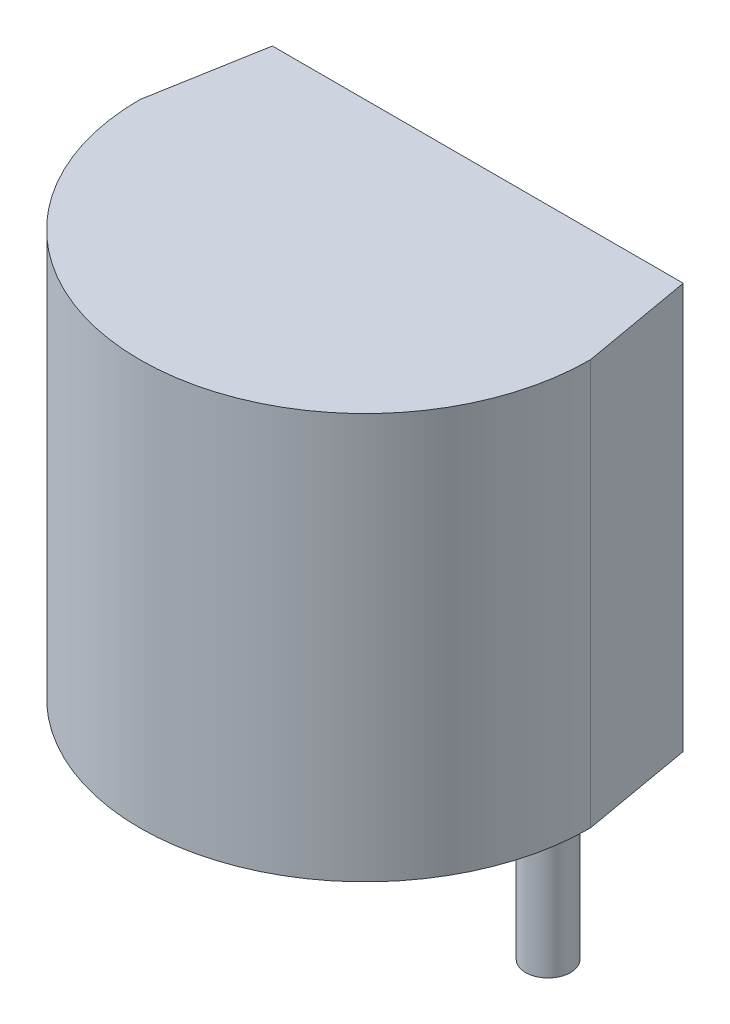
ISO-10303-21;
HEADER;
FILE_DESCRIPTION(('STEP AP214'),'2;1');
FILE_NAME('part.step','',(''),(''),'','','');
FILE_SCHEMA(('AUTOMOTIVE_DESIGN { 1 0 10303 214 1 1 1 1 }'));
ENDSEC;
DATA;
#1=APPLICATION_CONTEXT('core data for automotive mechanical design processes');
#2=APPLICATION_PROTOCOL_DEFINITION('international standard','automotive_design',2000,#1);
#3=PRODUCT_CONTEXT('',#1,'mechanical');
#4=PRODUCT('Part','Part','',(#3));
#5=PRODUCT_RELATED_PRODUCT_CATEGORY('part','',(#4));
#6=PRODUCT_DEFINITION_FORMATION('','',#4);
#7=PRODUCT_DEFINITION_CONTEXT('part definition',#1,'design');
#8=PRODUCT_DEFINITION('design','',#6,#7);
#9=PRODUCT_DEFINITION_SHAPE('','',#8);
#10=(LENGTH_UNIT() NAMED_UNIT(*) SI_UNIT(.MILLI.,.METRE.));
#11=(NAMED_UNIT(*) PLANE_ANGLE_UNIT() SI_UNIT($,.RADIAN.));
#12=(NAMED_UNIT(*) SI_UNIT($,.STERADIAN.) SOLID_ANGLE_UNIT());
#13=UNCERTAINTY_MEASURE_WITH_UNIT(LENGTH_MEASURE(1.E-05),#10,'distance_accuracy_value','');
#14=(GEOMETRIC_REPRESENTATION_CONTEXT(3) GLOBAL_UNCERTAINTY_ASSIGNED_CONTEXT((#13)) GLOBAL_UNIT_ASSIGNED_CONTEXT((#10,
#11,#12)) REPRESENTATION_CONTEXT('',''));
#15=CARTESIAN_POINT('',(0.,0.,0.));
#16=DIRECTION('',(0.,0.,1.));
#17=DIRECTION('',(1.,0.,0.));
#18=AXIS2_PLACEMENT_3D('',#15,#16,#17);
#19=CARTESIAN_POINT('',(1.52959127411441,-2.,-0.5));
#20=DIRECTION('',(0.,1.,0.));
#21=DIRECTION('',(0.,0.,1.));
#22=AXIS2_PLACEMENT_3D('',#19,#20,#21);
#23=CYLINDRICAL_SURFACE('',#22,0.25);
#24=CARTESIAN_POINT('',(1.52959127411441,0.,-0.5));
#25=DIRECTION('',(0.,1.,0.));
#26=DIRECTION('',(0.,0.,-1.));
#27=AXIS2_PLACEMENT_3D('',#24,#25,#26);
#28=CIRCLE('',#27,0.25);
#29=CARTESIAN_POINT('',(1.52959127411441,0.,-0.75));
#30=VERTEX_POINT('',#29);
#31=EDGE_CURVE('E80',#30,#30,#28,.T.);
#32=ORIENTED_EDGE('',*,*,#31,.F.);
#33=EDGE_LOOP('',(#32));
#34=FACE_BOUND('',#33,.T.);
#35=CARTESIAN_POINT('',(1.52959127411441,-2.,-0.5));
#36=DIRECTION('',(0.,1.,0.));
#37=DIRECTION('',(0.,0.,-1.));
#38=AXIS2_PLACEMENT_3D('',#35,#36,#37);
#39=CIRCLE('',#38,0.25);
#40=CARTESIAN_POINT('',(1.52959127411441,-2.,-0.75));
#41=VERTEX_POINT('',#40);
#42=EDGE_CURVE('E11',#41,#41,#39,.T.);
#43=ORIENTED_EDGE('',*,*,#42,.T.);
#44=EDGE_LOOP('',(#43));
#45=FACE_BOUND('',#44,.T.);
#46=ADVANCED_FACE('F17',(#34,#45),#23,.T.);
#47=CARTESIAN_POINT('',(-1.52959127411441,-2.,-0.500000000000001));
#48=DIRECTION('',(0.,1.,0.));
#49=DIRECTION('',(0.,0.,1.));
#50=AXIS2_PLACEMENT_3D('',#47,#48,#49);
#51=CYLINDRICAL_SURFACE('',#50,0.25);
#52=CARTESIAN_POINT('',(-1.52959127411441,0.,-0.500000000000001));
#53=DIRECTION('',(0.,1.,0.));
#54=DIRECTION('',(0.,0.,1.));
#55=AXIS2_PLACEMENT_3D('',#52,#53,#54);
#56=CIRCLE('',#55,0.25);
#57=CARTESIAN_POINT('',(-1.52959127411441,0.,-0.250000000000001));
#58=VERTEX_POINT('',#57);
#59=EDGE_CURVE('E82',#58,#58,#56,.T.);
#60=ORIENTED_EDGE('',*,*,#59,.F.);
#61=EDGE_LOOP('',(#60));
#62=FACE_BOUND('',#61,.T.);
#63=CARTESIAN_POINT('',(-1.52959127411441,-2.,-0.500000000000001));
#64=DIRECTION('',(0.,1.,0.));
#65=DIRECTION('',(0.,0.,1.));
#66=AXIS2_PLACEMENT_3D('',#63,#64,#65);
#67=CIRCLE('',#66,0.25);
#68=CARTESIAN_POINT('',(-1.52959127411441,-2.,-0.250000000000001));
#69=VERTEX_POINT('',#68);
#70=EDGE_CURVE('E27',#69,#69,#67,.T.);
#71=ORIENTED_EDGE('',*,*,#70,.T.);
#72=EDGE_LOOP('',(#71));
#73=FACE_BOUND('',#72,.T.);
#74=ADVANCED_FACE('F116',(#62,#73),#51,.T.);
#75=CARTESIAN_POINT('',(-2.27959127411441,4.5,-1.25));
#76=DIRECTION('',(0.,0.,1.));
#77=DIRECTION('',(1.,0.,0.));
#78=AXIS2_PLACEMENT_3D('',#75,#76,#77);
#79=PLANE('',#78);
#80=DIRECTION('',(-1.,0.,0.));
#81=VECTOR('',#80,1.);
#82=CARTESIAN_POINT('',(-2.27959127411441,0.,-1.25));
#83=LINE('',#82,#81);
#84=CARTESIAN_POINT('',(2.27959127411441,0.,-1.25));
#85=VERTEX_POINT('',#84);
#86=CARTESIAN_POINT('',(-2.27959127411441,0.,-1.25));
#87=VERTEX_POINT('',#86);
#88=EDGE_CURVE('E90',#85,#87,#83,.T.);
#89=ORIENTED_EDGE('',*,*,#88,.T.);
#90=DIRECTION('',(0.,-1.,0.));
#91=VECTOR('',#90,1.);
#92=CARTESIAN_POINT('',(-2.27959127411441,4.5,-1.25));
#93=LINE('',#92,#91);
#94=CARTESIAN_POINT('',(-2.27959127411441,4.5,-1.25));
#95=VERTEX_POINT('',#94);
#96=EDGE_CURVE('E36',#95,#87,#93,.T.);
#97=ORIENTED_EDGE('',*,*,#96,.F.);
#98=DIRECTION('',(-1.,0.,0.));
#99=VECTOR('',#98,1.);
#100=CARTESIAN_POINT('',(-2.27959127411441,4.5,-1.25));
#101=LINE('',#100,#99);
#102=CARTESIAN_POINT('',(2.27959127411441,4.5,-1.25));
#103=VERTEX_POINT('',#102);
#104=EDGE_CURVE('E74',#103,#95,#101,.T.);
#105=ORIENTED_EDGE('',*,*,#104,.F.);
#106=DIRECTION('',(0.,-1.,0.));
#107=VECTOR('',#106,1.);
#108=CARTESIAN_POINT('',(2.27959127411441,4.5,-1.25));
#109=LINE('',#108,#107);
#110=EDGE_CURVE('E79',#103,#85,#109,.T.);
#111=ORIENTED_EDGE('',*,*,#110,.T.);
#112=EDGE_LOOP('',(#89,#97,#105,#111));
#113=FACE_BOUND('',#112,.T.);
#114=ADVANCED_FACE('F106',(#113),#79,.F.);
#115=CARTESIAN_POINT('',(-2.5,4.5,0.));
#116=DIRECTION('',(0.984807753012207,0.,0.173648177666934));
#117=DIRECTION('',(0.173648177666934,0.,-0.984807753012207));
#118=AXIS2_PLACEMENT_3D('',#115,#116,#117);
#119=PLANE('',#118);
#120=DIRECTION('',(-0.173648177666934,0.,0.984807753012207));
#121=VECTOR('',#120,1.);
#122=CARTESIAN_POINT('',(-2.5,0.,0.));
#123=LINE('',#122,#121);
#124=CARTESIAN_POINT('',(-2.5,0.,0.));
#125=VERTEX_POINT('',#124);
#126=EDGE_CURVE('E94',#87,#125,#123,.T.);
#127=ORIENTED_EDGE('',*,*,#126,.T.);
#128=DIRECTION('',(0.,-1.,0.));
#129=VECTOR('',#128,1.);
#130=CARTESIAN_POINT('',(-2.5,4.5,0.));
#131=LINE('',#130,#129);
#132=CARTESIAN_POINT('',(-2.5,4.5,0.));
#133=VERTEX_POINT('',#132);
#134=EDGE_CURVE('E98',#133,#125,#131,.T.);
#135=ORIENTED_EDGE('',*,*,#134,.F.);
#136=DIRECTION('',(-0.173648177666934,0.,0.984807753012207));
#137=VECTOR('',#136,1.);
#138=CARTESIAN_POINT('',(-2.5,4.5,0.));
#139=LINE('',#138,#137);
#140=EDGE_CURVE('E65',#95,#133,#139,.T.);
#141=ORIENTED_EDGE('',*,*,#140,.F.);
#142=ORIENTED_EDGE('',*,*,#96,.T.);
#143=EDGE_LOOP('',(#127,#135,#141,#142));
#144=FACE_BOUND('',#143,.T.);
#145=ADVANCED_FACE('F107',(#144),#119,.F.);
#146=CARTESIAN_POINT('',(0.,4.5,0.));
#147=DIRECTION('',(0.,-1.,0.));
#148=DIRECTION('',(0.,0.,-1.));
#149=AXIS2_PLACEMENT_3D('',#146,#147,#148);
#150=CYLINDRICAL_SURFACE('',#149,2.5);
#151=CARTESIAN_POINT('',(0.,0.,0.));
#152=DIRECTION('',(0.,1.,0.));
#153=DIRECTION('',(0.,0.,1.));
#154=AXIS2_PLACEMENT_3D('',#151,#152,#153);
#155=CIRCLE('',#154,2.5);
#156=CARTESIAN_POINT('',(2.5,0.,0.));
#157=VERTEX_POINT('',#156);
#158=EDGE_CURVE('E71',#125,#157,#155,.T.);
#159=ORIENTED_EDGE('',*,*,#158,.T.);
#160=DIRECTION('',(0.,-1.,0.));
#161=VECTOR('',#160,1.);
#162=CARTESIAN_POINT('',(2.5,4.5,0.));
#163=LINE('',#162,#161);
#164=CARTESIAN_POINT('',(2.5,4.5,0.));
#165=VERTEX_POINT('',#164);
#166=EDGE_CURVE('E57',#165,#157,#163,.T.);
#167=ORIENTED_EDGE('',*,*,#166,.F.);
#168=CARTESIAN_POINT('',(0.,4.5,0.));
#169=DIRECTION('',(0.,1.,0.));
#170=DIRECTION('',(0.,0.,1.));
#171=AXIS2_PLACEMENT_3D('',#168,#169,#170);
#172=CIRCLE('',#171,2.5);
#173=EDGE_CURVE('E63',#133,#165,#172,.T.);
#174=ORIENTED_EDGE('',*,*,#173,.F.);
#175=ORIENTED_EDGE('',*,*,#134,.T.);
#176=EDGE_LOOP('',(#159,#167,#174,#175));
#177=FACE_BOUND('',#176,.T.);
#178=ADVANCED_FACE('F69',(#177),#150,.T.);
#179=CARTESIAN_POINT('',(2.5,4.5,0.));
#180=DIRECTION('',(-0.984807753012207,0.,0.173648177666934));
#181=DIRECTION('',(0.173648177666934,0.,0.984807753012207));
#182=AXIS2_PLACEMENT_3D('',#179,#180,#181);
#183=PLANE('',#182);
#184=DIRECTION('',(-0.173648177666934,0.,-0.984807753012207));
#185=VECTOR('',#184,1.);
#186=CARTESIAN_POINT('',(2.5,0.,0.));
#187=LINE('',#186,#185);
#188=EDGE_CURVE('E73',#157,#85,#187,.T.);
#189=ORIENTED_EDGE('',*,*,#188,.T.);
#190=ORIENTED_EDGE('',*,*,#110,.F.);
#191=DIRECTION('',(-0.173648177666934,0.,-0.984807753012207));
#192=VECTOR('',#191,1.);
#193=CARTESIAN_POINT('',(2.5,4.5,0.));
#194=LINE('',#193,#192);
#195=EDGE_CURVE('E21',#165,#103,#194,.T.);
#196=ORIENTED_EDGE('',*,*,#195,.F.);
#197=ORIENTED_EDGE('',*,*,#166,.T.);
#198=EDGE_LOOP('',(#189,#190,#196,#197));
#199=FACE_BOUND('',#198,.T.);
#200=ADVANCED_FACE('F77',(#199),#183,.F.);
#201=CARTESIAN_POINT('',(0.,4.5,0.));
#202=DIRECTION('',(0.,1.,0.));
#203=DIRECTION('',(0.,0.,1.));
#204=AXIS2_PLACEMENT_3D('',#201,#202,#203);
#205=PLANE('',#204);
#206=ORIENTED_EDGE('',*,*,#104,.T.);
#207=ORIENTED_EDGE('',*,*,#140,.T.);
#208=ORIENTED_EDGE('',*,*,#173,.T.);
#209=ORIENTED_EDGE('',*,*,#195,.T.);
#210=EDGE_LOOP('',(#206,#207,#208,#209));
#211=FACE_BOUND('',#210,.T.);
#212=ADVANCED_FACE('F64',(#211),#205,.T.);
#213=CARTESIAN_POINT('',(0.,0.,0.));
#214=DIRECTION('',(0.,1.,0.));
#215=DIRECTION('',(0.,0.,1.));
#216=AXIS2_PLACEMENT_3D('',#213,#214,#215);
#217=PLANE('',#216);
#218=ORIENTED_EDGE('',*,*,#31,.T.);
#219=EDGE_LOOP('',(#218));
#220=FACE_BOUND('',#219,.T.);
#221=ORIENTED_EDGE('',*,*,#59,.T.);
#222=EDGE_LOOP('',(#221));
#223=FACE_BOUND('',#222,.T.);
#224=ORIENTED_EDGE('',*,*,#88,.F.);
#225=ORIENTED_EDGE('',*,*,#188,.F.);
#226=ORIENTED_EDGE('',*,*,#158,.F.);
#227=ORIENTED_EDGE('',*,*,#126,.F.);
#228=EDGE_LOOP('',(#224,#225,#226,#227));
#229=FACE_BOUND('',#228,.T.);
#230=ADVANCED_FACE('F103',(#220,#223,#229),#217,.F.);
#231=CARTESIAN_POINT('',(-1.52959127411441,-2.,-0.500000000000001));
#232=DIRECTION('',(0.,1.,0.));
#233=DIRECTION('',(0.,0.,1.));
#234=AXIS2_PLACEMENT_3D('',#231,#232,#233);
#235=PLANE('',#234);
#236=ORIENTED_EDGE('',*,*,#70,.F.);
#237=EDGE_LOOP('',(#236));
#238=FACE_BOUND('',#237,.T.);
#239=ADVANCED_FACE('F130',(#238),#235,.F.);
#240=CARTESIAN_POINT('',(1.52959127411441,-2.,-0.5));
#241=DIRECTION('',(0.,-1.,0.));
#242=DIRECTION('',(0.,0.,-1.));
#243=AXIS2_PLACEMENT_3D('',#240,#241,#242);
#244=PLANE('',#243);
#245=ORIENTED_EDGE('',*,*,#42,.F.);
#246=EDGE_LOOP('',(#245));
#247=FACE_BOUND('',#246,.T.);
#248=ADVANCED_FACE('F19',(#247),#244,.T.);
#249=CLOSED_SHELL('',(#46,#74,#114,#145,#178,#200,#212,#230,#239,#248));
#250=MANIFOLD_SOLID_BREP('B1',#249);
#251=ADVANCED_BREP_SHAPE_REPRESENTATION('',(#18,#250),#14);
#252=SHAPE_DEFINITION_REPRESENTATION(#9,#251);
ENDSEC;
END-ISO-10303-21;
